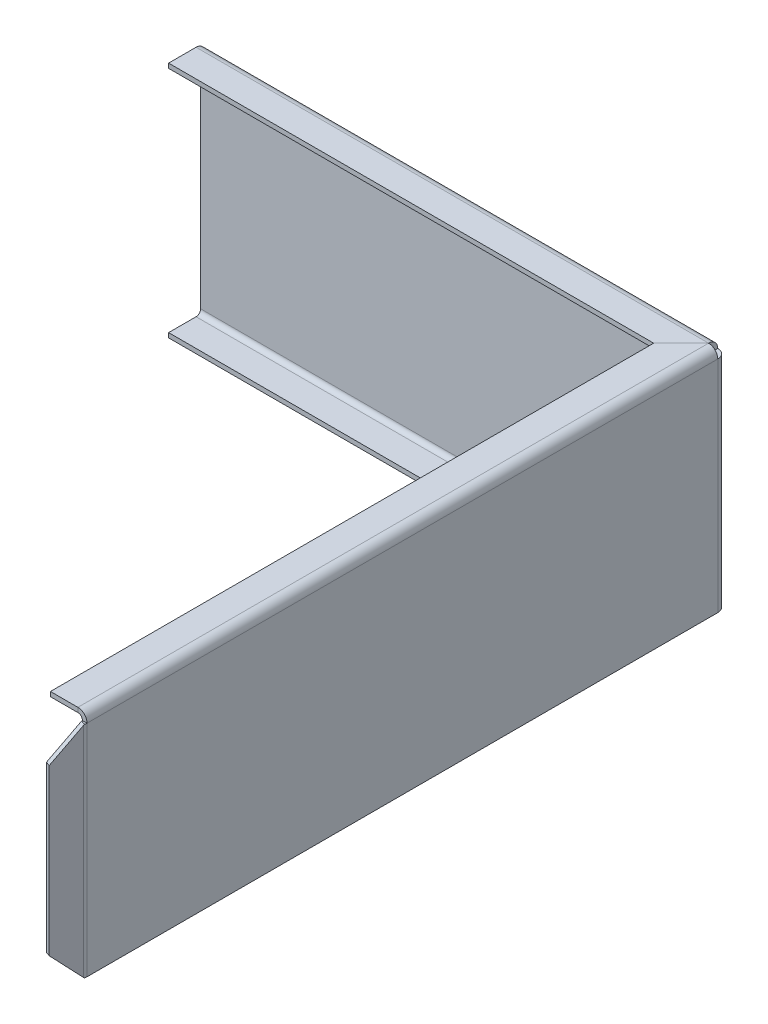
ISO-10303-21;
HEADER;
FILE_DESCRIPTION(('STEP AP214'),'2;1');
FILE_NAME('part.step','',(''),(''),'','','');
FILE_SCHEMA(('AUTOMOTIVE_DESIGN { 1 0 10303 214 1 1 1 1 }'));
ENDSEC;
DATA;
#1=APPLICATION_CONTEXT('core data for automotive mechanical design processes');
#2=APPLICATION_PROTOCOL_DEFINITION('international standard','automotive_design',2000,#1);
#3=PRODUCT_CONTEXT('',#1,'mechanical');
#4=PRODUCT('Part','Part','',(#3));
#5=PRODUCT_RELATED_PRODUCT_CATEGORY('part','',(#4));
#6=PRODUCT_DEFINITION_FORMATION('','',#4);
#7=PRODUCT_DEFINITION_CONTEXT('part definition',#1,'design');
#8=PRODUCT_DEFINITION('design','',#6,#7);
#9=PRODUCT_DEFINITION_SHAPE('','',#8);
#10=(LENGTH_UNIT() NAMED_UNIT(*) SI_UNIT(.MILLI.,.METRE.));
#11=(NAMED_UNIT(*) PLANE_ANGLE_UNIT() SI_UNIT($,.RADIAN.));
#12=(NAMED_UNIT(*) SI_UNIT($,.STERADIAN.) SOLID_ANGLE_UNIT());
#13=UNCERTAINTY_MEASURE_WITH_UNIT(LENGTH_MEASURE(1.E-05),#10,'distance_accuracy_value','');
#14=(GEOMETRIC_REPRESENTATION_CONTEXT(3) GLOBAL_UNCERTAINTY_ASSIGNED_CONTEXT((#13)) GLOBAL_UNIT_ASSIGNED_CONTEXT((#10,
#11,#12)) REPRESENTATION_CONTEXT('',''));
#15=CARTESIAN_POINT('',(0.,0.,0.));
#16=DIRECTION('',(0.,0.,1.));
#17=DIRECTION('',(1.,0.,0.));
#18=AXIS2_PLACEMENT_3D('',#15,#16,#17);
#19=CARTESIAN_POINT('',(145.,0.,2.5));
#20=DIRECTION('',(-1.,0.,0.));
#21=DIRECTION('',(0.,0.,1.));
#22=AXIS2_PLACEMENT_3D('',#19,#20,#21);
#23=PLANE('',#22);
#24=DIRECTION('',(0.,1.,0.));
#25=VECTOR('',#24,1.);
#26=CARTESIAN_POINT('',(145.000000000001,120.,349.559182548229));
#27=LINE('',#26,#25);
#28=CARTESIAN_POINT('',(145.000000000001,120.,349.559182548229));
#29=VERTEX_POINT('',#28);
#30=CARTESIAN_POINT('',(145.000000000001,0.,349.559182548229));
#31=VERTEX_POINT('',#30);
#32=EDGE_CURVE('E443',#29,#31,#27,.F.);
#33=ORIENTED_EDGE('',*,*,#32,.T.);
#34=DIRECTION('',(0.,0.,-1.));
#35=VECTOR('',#34,1.);
#36=CARTESIAN_POINT('',(145.000000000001,0.,350.));
#37=LINE('',#36,#35);
#38=CARTESIAN_POINT('',(145.,0.,5.));
#39=VERTEX_POINT('',#38);
#40=EDGE_CURVE('E466',#39,#31,#37,.F.);
#41=ORIENTED_EDGE('',*,*,#40,.F.);
#42=DIRECTION('',(0.,1.,0.));
#43=VECTOR('',#42,1.);
#44=CARTESIAN_POINT('',(145.,0.,5.));
#45=LINE('',#44,#43);
#46=CARTESIAN_POINT('',(145.,120.,4.99999999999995));
#47=VERTEX_POINT('',#46);
#48=EDGE_CURVE('E477',#47,#39,#45,.F.);
#49=ORIENTED_EDGE('',*,*,#48,.F.);
#50=DIRECTION('',(0.,0.,1.));
#51=VECTOR('',#50,1.);
#52=CARTESIAN_POINT('',(145.,120.,2.5));
#53=LINE('',#52,#51);
#54=EDGE_CURVE('E461',#29,#47,#53,.F.);
#55=ORIENTED_EDGE('',*,*,#54,.F.);
#56=EDGE_LOOP('',(#33,#41,#49,#55));
#57=FACE_BOUND('',#56,.T.);
#58=ADVANCED_FACE('F111',(#57),#23,.F.);
#59=CARTESIAN_POINT('',(142.5,0.,2.5));
#60=DIRECTION('',(-1.,0.,0.));
#61=DIRECTION('',(0.,0.,1.));
#62=AXIS2_PLACEMENT_3D('',#59,#60,#61);
#63=PLANE('',#62);
#64=DIRECTION('',(0.,0.,1.));
#65=VECTOR('',#64,1.);
#66=CARTESIAN_POINT('',(142.5,0.,2.5));
#67=LINE('',#66,#65);
#68=CARTESIAN_POINT('',(142.5,0.,5.));
#69=VERTEX_POINT('',#68);
#70=CARTESIAN_POINT('',(142.500000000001,0.,349.559182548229));
#71=VERTEX_POINT('',#70);
#72=EDGE_CURVE('E473',#69,#71,#67,.T.);
#73=ORIENTED_EDGE('',*,*,#72,.T.);
#74=DIRECTION('',(0.,1.,0.));
#75=VECTOR('',#74,1.);
#76=CARTESIAN_POINT('',(142.500000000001,120.,349.559182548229));
#77=LINE('',#76,#75);
#78=CARTESIAN_POINT('',(142.500000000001,120.,349.559182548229));
#79=VERTEX_POINT('',#78);
#80=EDGE_CURVE('E437',#79,#71,#77,.F.);
#81=ORIENTED_EDGE('',*,*,#80,.F.);
#82=DIRECTION('',(0.,0.,-1.));
#83=VECTOR('',#82,1.);
#84=CARTESIAN_POINT('',(142.5,120.,2.5));
#85=LINE('',#84,#83);
#86=CARTESIAN_POINT('',(142.5,120.,5.));
#87=VERTEX_POINT('',#86);
#88=EDGE_CURVE('E470',#79,#87,#85,.T.);
#89=ORIENTED_EDGE('',*,*,#88,.T.);
#90=DIRECTION('',(0.,1.,0.));
#91=VECTOR('',#90,1.);
#92=CARTESIAN_POINT('',(142.5,0.,5.));
#93=LINE('',#92,#91);
#94=EDGE_CURVE('E484',#69,#87,#93,.T.);
#95=ORIENTED_EDGE('',*,*,#94,.F.);
#96=EDGE_LOOP('',(#73,#81,#89,#95));
#97=FACE_BOUND('',#96,.T.);
#98=ADVANCED_FACE('F741',(#97),#63,.T.);
#99=CARTESIAN_POINT('',(140.,120.,0.));
#100=DIRECTION('',(1.,0.,0.));
#101=DIRECTION('',(0.,0.,-1.));
#102=AXIS2_PLACEMENT_3D('',#99,#100,#101);
#103=PLANE('',#102);
#104=DIRECTION('',(0.,0.,1.));
#105=VECTOR('',#104,1.);
#106=CARTESIAN_POINT('',(140.,120.,0.));
#107=LINE('',#106,#105);
#108=CARTESIAN_POINT('',(140.,120.,0.));
#109=VERTEX_POINT('',#108);
#110=CARTESIAN_POINT('',(140.,120.,2.5));
#111=VERTEX_POINT('',#110);
#112=EDGE_CURVE('E652',#109,#111,#107,.T.);
#113=ORIENTED_EDGE('',*,*,#112,.F.);
#114=CARTESIAN_POINT('',(140.,120.,5.));
#115=DIRECTION('',(-1.,0.,0.));
#116=DIRECTION('',(0.,0.,1.));
#117=AXIS2_PLACEMENT_3D('',#114,#115,#116);
#118=CIRCLE('',#117,5.);
#119=CARTESIAN_POINT('',(140.,125.,5.));
#120=VERTEX_POINT('',#119);
#121=EDGE_CURVE('E610',#109,#120,#118,.F.);
#122=ORIENTED_EDGE('',*,*,#121,.T.);
#123=DIRECTION('',(0.,1.,0.));
#124=VECTOR('',#123,1.);
#125=CARTESIAN_POINT('',(140.,122.5,5.));
#126=LINE('',#125,#124);
#127=CARTESIAN_POINT('',(140.,122.5,5.));
#128=VERTEX_POINT('',#127);
#129=EDGE_CURVE('E649',#128,#120,#126,.T.);
#130=ORIENTED_EDGE('',*,*,#129,.F.);
#131=CARTESIAN_POINT('',(140.,120.,5.));
#132=DIRECTION('',(1.,0.,0.));
#133=DIRECTION('',(0.,0.,-1.));
#134=AXIS2_PLACEMENT_3D('',#131,#132,#133);
#135=CIRCLE('',#134,2.5);
#136=EDGE_CURVE('E595',#111,#128,#135,.T.);
#137=ORIENTED_EDGE('',*,*,#136,.F.);
#138=EDGE_LOOP('',(#113,#122,#130,#137));
#139=FACE_BOUND('',#138,.T.);
#140=ADVANCED_FACE('F113',(#139),#103,.T.);
#141=CARTESIAN_POINT('',(-140.,125.,5.));
#142=DIRECTION('',(-1.,0.,0.));
#143=DIRECTION('',(0.,0.,1.));
#144=AXIS2_PLACEMENT_3D('',#141,#142,#143);
#145=PLANE('',#144);
#146=DIRECTION('',(0.,-1.,0.));
#147=VECTOR('',#146,1.);
#148=CARTESIAN_POINT('',(-140.,125.,5.));
#149=LINE('',#148,#147);
#150=CARTESIAN_POINT('',(-140.,125.,5.));
#151=VERTEX_POINT('',#150);
#152=CARTESIAN_POINT('',(-140.,122.5,5.));
#153=VERTEX_POINT('',#152);
#154=EDGE_CURVE('E646',#151,#153,#149,.T.);
#155=ORIENTED_EDGE('',*,*,#154,.F.);
#156=CARTESIAN_POINT('',(-140.,120.,5.));
#157=DIRECTION('',(-1.,0.,0.));
#158=DIRECTION('',(0.,0.,1.));
#159=AXIS2_PLACEMENT_3D('',#156,#157,#158);
#160=CIRCLE('',#159,5.);
#161=CARTESIAN_POINT('',(-140.,120.,0.));
#162=VERTEX_POINT('',#161);
#163=EDGE_CURVE('E591',#162,#151,#160,.F.);
#164=ORIENTED_EDGE('',*,*,#163,.F.);
#165=DIRECTION('',(0.,0.,-1.));
#166=VECTOR('',#165,1.);
#167=CARTESIAN_POINT('',(-140.,120.,2.5));
#168=LINE('',#167,#166);
#169=CARTESIAN_POINT('',(-140.,120.,2.5));
#170=VERTEX_POINT('',#169);
#171=EDGE_CURVE('E643',#170,#162,#168,.T.);
#172=ORIENTED_EDGE('',*,*,#171,.F.);
#173=CARTESIAN_POINT('',(-140.,120.,5.));
#174=DIRECTION('',(1.,0.,0.));
#175=DIRECTION('',(0.,0.,-1.));
#176=AXIS2_PLACEMENT_3D('',#173,#174,#175);
#177=CIRCLE('',#176,2.5);
#178=EDGE_CURVE('E575',#170,#153,#177,.T.);
#179=ORIENTED_EDGE('',*,*,#178,.T.);
#180=EDGE_LOOP('',(#155,#164,#172,#179));
#181=FACE_BOUND('',#180,.T.);
#182=ADVANCED_FACE('F718',(#181),#145,.T.);
#183=CARTESIAN_POINT('',(-140.,120.,2.5));
#184=DIRECTION('',(-1.,0.,0.));
#185=DIRECTION('',(0.,0.,1.));
#186=AXIS2_PLACEMENT_3D('',#183,#184,#185);
#187=PLANE('',#186);
#188=DIRECTION('',(0.,0.,1.));
#189=VECTOR('',#188,1.);
#190=CARTESIAN_POINT('',(-140.,125.,0.));
#191=LINE('',#190,#189);
#192=CARTESIAN_POINT('',(-140.,125.,20.));
#193=VERTEX_POINT('',#192);
#194=EDGE_CURVE('E560',#151,#193,#191,.T.);
#195=ORIENTED_EDGE('',*,*,#194,.F.);
#196=ORIENTED_EDGE('',*,*,#154,.T.);
#197=DIRECTION('',(0.,0.,-1.));
#198=VECTOR('',#197,1.);
#199=CARTESIAN_POINT('',(-140.,122.5,0.));
#200=LINE('',#199,#198);
#201=CARTESIAN_POINT('',(-140.,122.5,20.));
#202=VERTEX_POINT('',#201);
#203=EDGE_CURVE('E571',#153,#202,#200,.F.);
#204=ORIENTED_EDGE('',*,*,#203,.T.);
#205=DIRECTION('',(0.,1.,0.));
#206=VECTOR('',#205,1.);
#207=CARTESIAN_POINT('',(-140.,122.5,20.));
#208=LINE('',#207,#206);
#209=EDGE_CURVE('E567',#202,#193,#208,.T.);
#210=ORIENTED_EDGE('',*,*,#209,.T.);
#211=EDGE_LOOP('',(#195,#196,#204,#210));
#212=FACE_BOUND('',#211,.T.);
#213=ADVANCED_FACE('F1296',(#212),#187,.T.);
#214=CARTESIAN_POINT('',(140.,125.,0.));
#215=DIRECTION('',(0.,-1.,0.));
#216=DIRECTION('',(0.,0.,-1.));
#217=AXIS2_PLACEMENT_3D('',#214,#215,#216);
#218=PLANE('',#217);
#219=DIRECTION('',(-1.,0.,0.));
#220=VECTOR('',#219,1.);
#221=CARTESIAN_POINT('',(140.,125.,20.));
#222=LINE('',#221,#220);
#223=CARTESIAN_POINT('',(125.,125.,20.));
#224=VERTEX_POINT('',#223);
#225=EDGE_CURVE('E640',#224,#193,#222,.T.);
#226=ORIENTED_EDGE('',*,*,#225,.F.);
#227=DIRECTION('',(-0.707106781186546,0.,0.707106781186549));
#228=VECTOR('',#227,1.);
#229=CARTESIAN_POINT('',(125.,125.,20.));
#230=LINE('',#229,#228);
#231=EDGE_CURVE('E120',#224,#120,#230,.F.);
#232=ORIENTED_EDGE('',*,*,#231,.T.);
#233=DIRECTION('',(-1.,0.,0.));
#234=VECTOR('',#233,1.);
#235=CARTESIAN_POINT('',(140.,125.,5.));
#236=LINE('',#235,#234);
#237=EDGE_CURVE('E614',#120,#151,#236,.T.);
#238=ORIENTED_EDGE('',*,*,#237,.T.);
#239=ORIENTED_EDGE('',*,*,#194,.T.);
#240=EDGE_LOOP('',(#226,#232,#238,#239));
#241=FACE_BOUND('',#240,.T.);
#242=ADVANCED_FACE('F699',(#241),#218,.F.);
#243=CARTESIAN_POINT('',(140.,122.5,20.));
#244=DIRECTION('',(0.,0.,1.));
#245=DIRECTION('',(1.,0.,0.));
#246=AXIS2_PLACEMENT_3D('',#243,#244,#245);
#247=PLANE('',#246);
#248=DIRECTION('',(-1.,0.,0.));
#249=VECTOR('',#248,1.);
#250=CARTESIAN_POINT('',(140.,122.5,20.));
#251=LINE('',#250,#249);
#252=CARTESIAN_POINT('',(125.,122.5,20.));
#253=VERTEX_POINT('',#252);
#254=EDGE_CURVE('E637',#253,#202,#251,.T.);
#255=ORIENTED_EDGE('',*,*,#254,.F.);
#256=DIRECTION('',(0.,1.,0.));
#257=VECTOR('',#256,1.);
#258=CARTESIAN_POINT('',(125.,122.5,20.));
#259=LINE('',#258,#257);
#260=EDGE_CURVE('E694',#253,#224,#259,.T.);
#261=ORIENTED_EDGE('',*,*,#260,.T.);
#262=ORIENTED_EDGE('',*,*,#225,.T.);
#263=ORIENTED_EDGE('',*,*,#209,.F.);
#264=EDGE_LOOP('',(#255,#261,#262,#263));
#265=FACE_BOUND('',#264,.T.);
#266=ADVANCED_FACE('F711',(#265),#247,.T.);
#267=CARTESIAN_POINT('',(140.,122.5,0.));
#268=DIRECTION('',(0.,-1.,0.));
#269=DIRECTION('',(0.,0.,-1.));
#270=AXIS2_PLACEMENT_3D('',#267,#268,#269);
#271=PLANE('',#270);
#272=DIRECTION('',(-1.,0.,0.));
#273=VECTOR('',#272,1.);
#274=CARTESIAN_POINT('',(140.,122.5,5.));
#275=LINE('',#274,#273);
#276=EDGE_CURVE('E633',#128,#153,#275,.T.);
#277=ORIENTED_EDGE('',*,*,#276,.F.);
#278=DIRECTION('',(0.707106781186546,0.,-0.707106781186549));
#279=VECTOR('',#278,1.);
#280=CARTESIAN_POINT('',(142.5,122.5,2.49999999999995));
#281=LINE('',#280,#279);
#282=EDGE_CURVE('E15',#128,#253,#281,.F.);
#283=ORIENTED_EDGE('',*,*,#282,.T.);
#284=ORIENTED_EDGE('',*,*,#254,.T.);
#285=ORIENTED_EDGE('',*,*,#203,.F.);
#286=EDGE_LOOP('',(#277,#283,#284,#285));
#287=FACE_BOUND('',#286,.T.);
#288=ADVANCED_FACE('F714',(#287),#271,.T.);
#289=CARTESIAN_POINT('',(140.,120.,5.));
#290=DIRECTION('',(-1.,0.,0.));
#291=DIRECTION('',(0.,0.,1.));
#292=AXIS2_PLACEMENT_3D('',#289,#290,#291);
#293=CYLINDRICAL_SURFACE('',#292,2.5);
#294=ORIENTED_EDGE('',*,*,#178,.F.);
#295=DIRECTION('',(-1.,0.,0.));
#296=VECTOR('',#295,1.);
#297=CARTESIAN_POINT('',(140.,120.,2.5));
#298=LINE('',#297,#296);
#299=EDGE_CURVE('E629',#111,#170,#298,.T.);
#300=ORIENTED_EDGE('',*,*,#299,.F.);
#301=ORIENTED_EDGE('',*,*,#136,.T.);
#302=ORIENTED_EDGE('',*,*,#276,.T.);
#303=EDGE_LOOP('',(#294,#300,#301,#302));
#304=FACE_BOUND('',#303,.T.);
#305=ADVANCED_FACE('F720',(#304),#293,.F.);
#306=CARTESIAN_POINT('',(140.,0.,2.5));
#307=DIRECTION('',(0.,0.,1.));
#308=DIRECTION('',(1.,0.,0.));
#309=AXIS2_PLACEMENT_3D('',#306,#307,#308);
#310=PLANE('',#309);
#311=CARTESIAN_POINT('',(127.5,15.,2.5));
#312=DIRECTION('',(0.,0.,1.));
#313=DIRECTION('',(1.,0.,0.));
#314=AXIS2_PLACEMENT_3D('',#311,#312,#313);
#315=CIRCLE('',#314,10.);
#316=CARTESIAN_POINT('',(127.5,5.,2.5));
#317=VERTEX_POINT('',#316);
#318=CARTESIAN_POINT('',(127.5,25.,2.5));
#319=VERTEX_POINT('',#318);
#320=EDGE_CURVE('E413',#317,#319,#315,.T.);
#321=ORIENTED_EDGE('',*,*,#320,.F.);
#322=DIRECTION('',(1.,0.,0.));
#323=VECTOR('',#322,1.);
#324=CARTESIAN_POINT('',(140.,5.,2.5));
#325=LINE('',#324,#323);
#326=CARTESIAN_POINT('',(102.5,5.,2.5));
#327=VERTEX_POINT('',#326);
#328=EDGE_CURVE('E394',#327,#317,#325,.T.);
#329=ORIENTED_EDGE('',*,*,#328,.F.);
#330=CARTESIAN_POINT('',(102.5,15.,2.5));
#331=DIRECTION('',(0.,0.,1.));
#332=DIRECTION('',(1.,0.,0.));
#333=AXIS2_PLACEMENT_3D('',#330,#331,#332);
#334=CIRCLE('',#333,10.);
#335=CARTESIAN_POINT('',(102.5,25.,2.5));
#336=VERTEX_POINT('',#335);
#337=EDGE_CURVE('E406',#336,#327,#334,.T.);
#338=ORIENTED_EDGE('',*,*,#337,.F.);
#339=DIRECTION('',(-1.,0.,0.));
#340=VECTOR('',#339,1.);
#341=CARTESIAN_POINT('',(140.,25.,2.5));
#342=LINE('',#341,#340);
#343=EDGE_CURVE('E410',#319,#336,#342,.T.);
#344=ORIENTED_EDGE('',*,*,#343,.F.);
#345=EDGE_LOOP('',(#321,#329,#338,#344));
#346=FACE_BOUND('',#345,.T.);
#347=DIRECTION('',(0.,1.,0.));
#348=VECTOR('',#347,1.);
#349=CARTESIAN_POINT('',(-140.,0.,2.5));
#350=LINE('',#349,#348);
#351=CARTESIAN_POINT('',(-140.,0.,2.5));
#352=VERTEX_POINT('',#351);
#353=EDGE_CURVE('E579',#352,#170,#350,.T.);
#354=ORIENTED_EDGE('',*,*,#353,.F.);
#355=DIRECTION('',(-1.,0.,0.));
#356=VECTOR('',#355,1.);
#357=CARTESIAN_POINT('',(140.,0.,2.5));
#358=LINE('',#357,#356);
#359=CARTESIAN_POINT('',(140.,0.,2.5));
#360=VERTEX_POINT('',#359);
#361=EDGE_CURVE('E626',#360,#352,#358,.T.);
#362=ORIENTED_EDGE('',*,*,#361,.F.);
#363=DIRECTION('',(0.,1.,0.));
#364=VECTOR('',#363,1.);
#365=CARTESIAN_POINT('',(140.,0.,2.5));
#366=LINE('',#365,#364);
#367=EDGE_CURVE('E599',#360,#111,#366,.T.);
#368=ORIENTED_EDGE('',*,*,#367,.T.);
#369=ORIENTED_EDGE('',*,*,#299,.T.);
#370=EDGE_LOOP('',(#354,#362,#368,#369));
#371=FACE_BOUND('',#370,.T.);
#372=ADVANCED_FACE('F728',(#346,#371),#310,.T.);
#373=CARTESIAN_POINT('',(140.,0.,0.));
#374=DIRECTION('',(0.,0.,1.));
#375=DIRECTION('',(1.,0.,0.));
#376=AXIS2_PLACEMENT_3D('',#373,#374,#375);
#377=PLANE('',#376);
#378=DIRECTION('',(-1.,0.,0.));
#379=VECTOR('',#378,1.);
#380=CARTESIAN_POINT('',(127.5,5.,0.));
#381=LINE('',#380,#379);
#382=CARTESIAN_POINT('',(127.5,5.,0.));
#383=VERTEX_POINT('',#382);
#384=CARTESIAN_POINT('',(102.5,5.,0.));
#385=VERTEX_POINT('',#384);
#386=EDGE_CURVE('E378',#383,#385,#381,.T.);
#387=ORIENTED_EDGE('',*,*,#386,.F.);
#388=CARTESIAN_POINT('',(127.5,15.,0.));
#389=DIRECTION('',(0.,0.,-1.));
#390=DIRECTION('',(1.,0.,0.));
#391=AXIS2_PLACEMENT_3D('',#388,#389,#390);
#392=CIRCLE('',#391,10.);
#393=CARTESIAN_POINT('',(127.5,25.,0.));
#394=VERTEX_POINT('',#393);
#395=EDGE_CURVE('E372',#394,#383,#392,.T.);
#396=ORIENTED_EDGE('',*,*,#395,.F.);
#397=DIRECTION('',(1.,0.,0.));
#398=VECTOR('',#397,1.);
#399=CARTESIAN_POINT('',(127.5,25.,0.));
#400=LINE('',#399,#398);
#401=CARTESIAN_POINT('',(102.5,25.,0.));
#402=VERTEX_POINT('',#401);
#403=EDGE_CURVE('E386',#402,#394,#400,.T.);
#404=ORIENTED_EDGE('',*,*,#403,.F.);
#405=CARTESIAN_POINT('',(102.5,15.,0.));
#406=DIRECTION('',(0.,0.,-1.));
#407=DIRECTION('',(-1.,0.,0.));
#408=AXIS2_PLACEMENT_3D('',#405,#406,#407);
#409=CIRCLE('',#408,10.);
#410=EDGE_CURVE('E382',#385,#402,#409,.T.);
#411=ORIENTED_EDGE('',*,*,#410,.F.);
#412=EDGE_LOOP('',(#387,#396,#404,#411));
#413=FACE_BOUND('',#412,.T.);
#414=DIRECTION('',(0.,1.,0.));
#415=VECTOR('',#414,1.);
#416=CARTESIAN_POINT('',(-140.,0.,0.));
#417=LINE('',#416,#415);
#418=CARTESIAN_POINT('',(-140.,0.,0.));
#419=VERTEX_POINT('',#418);
#420=EDGE_CURVE('E587',#419,#162,#417,.T.);
#421=ORIENTED_EDGE('',*,*,#420,.T.);
#422=DIRECTION('',(-1.,0.,0.));
#423=VECTOR('',#422,1.);
#424=CARTESIAN_POINT('',(140.,120.,0.));
#425=LINE('',#424,#423);
#426=EDGE_CURVE('E618',#109,#162,#425,.T.);
#427=ORIENTED_EDGE('',*,*,#426,.F.);
#428=DIRECTION('',(0.,1.,0.));
#429=VECTOR('',#428,1.);
#430=CARTESIAN_POINT('',(140.,0.,0.));
#431=LINE('',#430,#429);
#432=CARTESIAN_POINT('',(140.,0.,0.));
#433=VERTEX_POINT('',#432);
#434=EDGE_CURVE('E606',#433,#109,#431,.T.);
#435=ORIENTED_EDGE('',*,*,#434,.F.);
#436=DIRECTION('',(-1.,0.,0.));
#437=VECTOR('',#436,1.);
#438=CARTESIAN_POINT('',(140.,0.,0.));
#439=LINE('',#438,#437);
#440=EDGE_CURVE('E622',#433,#419,#439,.T.);
#441=ORIENTED_EDGE('',*,*,#440,.T.);
#442=EDGE_LOOP('',(#421,#427,#435,#441));
#443=FACE_BOUND('',#442,.T.);
#444=ADVANCED_FACE('F801',(#413,#443),#377,.F.);
#445=CARTESIAN_POINT('',(140.,120.,5.));
#446=DIRECTION('',(-1.,0.,0.));
#447=DIRECTION('',(0.,0.,1.));
#448=AXIS2_PLACEMENT_3D('',#445,#446,#447);
#449=CYLINDRICAL_SURFACE('',#448,5.);
#450=ORIENTED_EDGE('',*,*,#163,.T.);
#451=ORIENTED_EDGE('',*,*,#237,.F.);
#452=ORIENTED_EDGE('',*,*,#121,.F.);
#453=ORIENTED_EDGE('',*,*,#426,.T.);
#454=EDGE_LOOP('',(#450,#451,#452,#453));
#455=FACE_BOUND('',#454,.T.);
#456=ADVANCED_FACE('F707',(#455),#449,.T.);
#457=CARTESIAN_POINT('',(-140.,120.,5.));
#458=DIRECTION('',(1.,0.,0.));
#459=DIRECTION('',(0.,0.,-1.));
#460=AXIS2_PLACEMENT_3D('',#457,#458,#459);
#461=PLANE('',#460);
#462=ORIENTED_EDGE('',*,*,#353,.T.);
#463=ORIENTED_EDGE('',*,*,#171,.T.);
#464=ORIENTED_EDGE('',*,*,#420,.F.);
#465=DIRECTION('',(0.,0.,1.));
#466=VECTOR('',#465,1.);
#467=CARTESIAN_POINT('',(-140.,0.,0.));
#468=LINE('',#467,#466);
#469=EDGE_CURVE('E583',#419,#352,#468,.T.);
#470=ORIENTED_EDGE('',*,*,#469,.T.);
#471=EDGE_LOOP('',(#462,#463,#464,#470));
#472=FACE_BOUND('',#471,.T.);
#473=ADVANCED_FACE('F723',(#472),#461,.F.);
#474=CARTESIAN_POINT('',(-140.,0.,5.));
#475=DIRECTION('',(-1.,0.,0.));
#476=DIRECTION('',(0.,0.,1.));
#477=AXIS2_PLACEMENT_3D('',#474,#475,#476);
#478=PLANE('',#477);
#479=DIRECTION('',(0.,1.,0.));
#480=VECTOR('',#479,1.);
#481=CARTESIAN_POINT('',(-140.,-5.,5.));
#482=LINE('',#481,#480);
#483=CARTESIAN_POINT('',(-140.,-2.49999999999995,5.));
#484=VERTEX_POINT('',#483);
#485=CARTESIAN_POINT('',(-140.,-5.,5.));
#486=VERTEX_POINT('',#485);
#487=EDGE_CURVE('E503',#484,#486,#482,.F.);
#488=ORIENTED_EDGE('',*,*,#487,.F.);
#489=CARTESIAN_POINT('',(-140.,0.,5.));
#490=DIRECTION('',(1.,0.,0.));
#491=DIRECTION('',(0.,0.,-1.));
#492=AXIS2_PLACEMENT_3D('',#489,#490,#491);
#493=CIRCLE('',#492,2.5);
#494=EDGE_CURVE('E548',#352,#484,#493,.F.);
#495=ORIENTED_EDGE('',*,*,#494,.F.);
#496=ORIENTED_EDGE('',*,*,#469,.F.);
#497=CARTESIAN_POINT('',(-140.,0.,5.));
#498=DIRECTION('',(1.,0.,0.));
#499=DIRECTION('',(0.,0.,-1.));
#500=AXIS2_PLACEMENT_3D('',#497,#498,#499);
#501=CIRCLE('',#500,5.);
#502=EDGE_CURVE('E556',#419,#486,#501,.F.);
#503=ORIENTED_EDGE('',*,*,#502,.T.);
#504=EDGE_LOOP('',(#488,#495,#496,#503));
#505=FACE_BOUND('',#504,.T.);
#506=ADVANCED_FACE('F834',(#505),#478,.T.);
#507=CARTESIAN_POINT('',(140.,0.,5.));
#508=DIRECTION('',(-1.,0.,0.));
#509=DIRECTION('',(0.,0.,1.));
#510=AXIS2_PLACEMENT_3D('',#507,#508,#509);
#511=PLANE('',#510);
#512=CARTESIAN_POINT('',(140.,0.,5.));
#513=DIRECTION('',(1.,0.,0.));
#514=DIRECTION('',(0.,0.,-1.));
#515=AXIS2_PLACEMENT_3D('',#512,#513,#514);
#516=CIRCLE('',#515,2.5);
#517=CARTESIAN_POINT('',(140.,-2.49999999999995,5.));
#518=VERTEX_POINT('',#517);
#519=EDGE_CURVE('E511',#518,#360,#516,.T.);
#520=ORIENTED_EDGE('',*,*,#519,.F.);
#521=DIRECTION('',(0.,1.,0.));
#522=VECTOR('',#521,1.);
#523=CARTESIAN_POINT('',(140.,-2.49999999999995,5.));
#524=LINE('',#523,#522);
#525=CARTESIAN_POINT('',(140.,-5.,5.));
#526=VERTEX_POINT('',#525);
#527=EDGE_CURVE('E538',#518,#526,#524,.F.);
#528=ORIENTED_EDGE('',*,*,#527,.T.);
#529=CARTESIAN_POINT('',(140.,0.,5.));
#530=DIRECTION('',(1.,0.,0.));
#531=DIRECTION('',(0.,0.,-1.));
#532=AXIS2_PLACEMENT_3D('',#529,#530,#531);
#533=CIRCLE('',#532,5.);
#534=EDGE_CURVE('E552',#526,#433,#533,.T.);
#535=ORIENTED_EDGE('',*,*,#534,.T.);
#536=DIRECTION('',(0.,0.,1.));
#537=VECTOR('',#536,1.);
#538=CARTESIAN_POINT('',(140.,0.,0.));
#539=LINE('',#538,#537);
#540=EDGE_CURVE('E603',#433,#360,#539,.T.);
#541=ORIENTED_EDGE('',*,*,#540,.T.);
#542=EDGE_LOOP('',(#520,#528,#535,#541));
#543=FACE_BOUND('',#542,.T.);
#544=ADVANCED_FACE('F806',(#543),#511,.F.);
#545=CARTESIAN_POINT('',(140.,0.,5.));
#546=DIRECTION('',(1.,0.,0.));
#547=DIRECTION('',(0.,-1.,0.));
#548=AXIS2_PLACEMENT_3D('',#545,#546,#547);
#549=CYLINDRICAL_SURFACE('',#548,5.);
#550=ORIENTED_EDGE('',*,*,#440,.F.);
#551=ORIENTED_EDGE('',*,*,#534,.F.);
#552=DIRECTION('',(1.,0.,0.));
#553=VECTOR('',#552,1.);
#554=CARTESIAN_POINT('',(-140.,-5.,5.));
#555=LINE('',#554,#553);
#556=EDGE_CURVE('E535',#526,#486,#555,.F.);
#557=ORIENTED_EDGE('',*,*,#556,.T.);
#558=ORIENTED_EDGE('',*,*,#502,.F.);
#559=EDGE_LOOP('',(#550,#551,#557,#558));
#560=FACE_BOUND('',#559,.T.);
#561=ADVANCED_FACE('F832',(#560),#549,.T.);
#562=CARTESIAN_POINT('',(140.,0.,5.));
#563=DIRECTION('',(1.,0.,0.));
#564=DIRECTION('',(0.,-1.,0.));
#565=AXIS2_PLACEMENT_3D('',#562,#563,#564);
#566=CYLINDRICAL_SURFACE('',#565,2.5);
#567=ORIENTED_EDGE('',*,*,#361,.T.);
#568=ORIENTED_EDGE('',*,*,#494,.T.);
#569=DIRECTION('',(1.,0.,0.));
#570=VECTOR('',#569,1.);
#571=CARTESIAN_POINT('',(-140.,-2.49999999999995,5.));
#572=LINE('',#571,#570);
#573=EDGE_CURVE('E542',#484,#518,#572,.T.);
#574=ORIENTED_EDGE('',*,*,#573,.T.);
#575=ORIENTED_EDGE('',*,*,#519,.T.);
#576=EDGE_LOOP('',(#567,#568,#574,#575));
#577=FACE_BOUND('',#576,.T.);
#578=ADVANCED_FACE('F809',(#577),#566,.F.);
#579=CARTESIAN_POINT('',(140.,-5.,20.));
#580=DIRECTION('',(-1.,0.,0.));
#581=DIRECTION('',(0.,0.,1.));
#582=AXIS2_PLACEMENT_3D('',#579,#580,#581);
#583=PLANE('',#582);
#584=ORIENTED_EDGE('',*,*,#527,.F.);
#585=DIRECTION('',(0.,0.,-1.));
#586=VECTOR('',#585,1.);
#587=CARTESIAN_POINT('',(140.,-2.50000000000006,20.));
#588=LINE('',#587,#586);
#589=CARTESIAN_POINT('',(140.,-2.50000000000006,20.));
#590=VERTEX_POINT('',#589);
#591=EDGE_CURVE('E532',#518,#590,#588,.F.);
#592=ORIENTED_EDGE('',*,*,#591,.T.);
#593=DIRECTION('',(0.,1.,0.));
#594=VECTOR('',#593,1.);
#595=CARTESIAN_POINT('',(140.,-5.,20.));
#596=LINE('',#595,#594);
#597=CARTESIAN_POINT('',(140.,-5.,20.));
#598=VERTEX_POINT('',#597);
#599=EDGE_CURVE('E507',#598,#590,#596,.T.);
#600=ORIENTED_EDGE('',*,*,#599,.F.);
#601=DIRECTION('',(0.,0.,1.));
#602=VECTOR('',#601,1.);
#603=CARTESIAN_POINT('',(140.,-5.,2.5));
#604=LINE('',#603,#602);
#605=EDGE_CURVE('E523',#526,#598,#604,.T.);
#606=ORIENTED_EDGE('',*,*,#605,.F.);
#607=EDGE_LOOP('',(#584,#592,#600,#606));
#608=FACE_BOUND('',#607,.T.);
#609=ADVANCED_FACE('F827',(#608),#583,.F.);
#610=CARTESIAN_POINT('',(-140.,-5.,2.5));
#611=DIRECTION('',(1.,0.,0.));
#612=DIRECTION('',(0.,0.,-1.));
#613=AXIS2_PLACEMENT_3D('',#610,#611,#612);
#614=PLANE('',#613);
#615=ORIENTED_EDGE('',*,*,#487,.T.);
#616=DIRECTION('',(0.,0.,-1.));
#617=VECTOR('',#616,1.);
#618=CARTESIAN_POINT('',(-140.,-5.,2.5));
#619=LINE('',#618,#617);
#620=CARTESIAN_POINT('',(-140.,-5.,20.));
#621=VERTEX_POINT('',#620);
#622=EDGE_CURVE('E516',#621,#486,#619,.T.);
#623=ORIENTED_EDGE('',*,*,#622,.F.);
#624=DIRECTION('',(0.,1.,0.));
#625=VECTOR('',#624,1.);
#626=CARTESIAN_POINT('',(-140.,-5.,20.));
#627=LINE('',#626,#625);
#628=CARTESIAN_POINT('',(-140.,-2.50000000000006,20.));
#629=VERTEX_POINT('',#628);
#630=EDGE_CURVE('E512',#621,#629,#627,.T.);
#631=ORIENTED_EDGE('',*,*,#630,.T.);
#632=DIRECTION('',(0.,0.,1.));
#633=VECTOR('',#632,1.);
#634=CARTESIAN_POINT('',(-140.,-2.49999999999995,2.5));
#635=LINE('',#634,#633);
#636=EDGE_CURVE('E526',#629,#484,#635,.F.);
#637=ORIENTED_EDGE('',*,*,#636,.T.);
#638=EDGE_LOOP('',(#615,#623,#631,#637));
#639=FACE_BOUND('',#638,.T.);
#640=ADVANCED_FACE('F818',(#639),#614,.F.);
#641=CARTESIAN_POINT('',(-140.,-5.,2.5));
#642=DIRECTION('',(0.,1.,0.));
#643=DIRECTION('',(0.,0.,1.));
#644=AXIS2_PLACEMENT_3D('',#641,#642,#643);
#645=PLANE('',#644);
#646=ORIENTED_EDGE('',*,*,#556,.F.);
#647=ORIENTED_EDGE('',*,*,#605,.T.);
#648=DIRECTION('',(-1.,0.,0.));
#649=VECTOR('',#648,1.);
#650=CARTESIAN_POINT('',(-140.,-5.,20.));
#651=LINE('',#650,#649);
#652=EDGE_CURVE('E520',#598,#621,#651,.T.);
#653=ORIENTED_EDGE('',*,*,#652,.T.);
#654=ORIENTED_EDGE('',*,*,#622,.T.);
#655=EDGE_LOOP('',(#646,#647,#653,#654));
#656=FACE_BOUND('',#655,.T.);
#657=ADVANCED_FACE('F830',(#656),#645,.F.);
#658=CARTESIAN_POINT('',(-140.,-2.49999999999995,2.5));
#659=DIRECTION('',(0.,1.,0.));
#660=DIRECTION('',(0.,0.,1.));
#661=AXIS2_PLACEMENT_3D('',#658,#659,#660);
#662=PLANE('',#661);
#663=ORIENTED_EDGE('',*,*,#591,.F.);
#664=ORIENTED_EDGE('',*,*,#573,.F.);
#665=ORIENTED_EDGE('',*,*,#636,.F.);
#666=DIRECTION('',(1.,0.,0.));
#667=VECTOR('',#666,1.);
#668=CARTESIAN_POINT('',(-140.,-2.50000000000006,20.));
#669=LINE('',#668,#667);
#670=EDGE_CURVE('E530',#590,#629,#669,.F.);
#671=ORIENTED_EDGE('',*,*,#670,.F.);
#672=EDGE_LOOP('',(#663,#664,#665,#671));
#673=FACE_BOUND('',#672,.T.);
#674=ADVANCED_FACE('F815',(#673),#662,.T.);
#675=CARTESIAN_POINT('',(-140.,-5.,20.));
#676=DIRECTION('',(0.,0.,-1.));
#677=DIRECTION('',(0.,1.,0.));
#678=AXIS2_PLACEMENT_3D('',#675,#676,#677);
#679=PLANE('',#678);
#680=ORIENTED_EDGE('',*,*,#670,.T.);
#681=ORIENTED_EDGE('',*,*,#630,.F.);
#682=ORIENTED_EDGE('',*,*,#652,.F.);
#683=ORIENTED_EDGE('',*,*,#599,.T.);
#684=EDGE_LOOP('',(#680,#681,#682,#683));
#685=FACE_BOUND('',#684,.T.);
#686=ADVANCED_FACE('F823',(#685),#679,.F.);
#687=CARTESIAN_POINT('',(140.,0.,5.));
#688=DIRECTION('',(0.,-1.,0.));
#689=DIRECTION('',(0.,0.,-1.));
#690=AXIS2_PLACEMENT_3D('',#687,#688,#689);
#691=PLANE('',#690);
#692=DIRECTION('',(1.,0.,0.));
#693=VECTOR('',#692,1.);
#694=CARTESIAN_POINT('',(145.,0.,5.));
#695=LINE('',#694,#693);
#696=EDGE_CURVE('E457',#69,#39,#695,.T.);
#697=ORIENTED_EDGE('',*,*,#696,.F.);
#698=CARTESIAN_POINT('',(140.,0.,5.));
#699=DIRECTION('',(0.,1.,0.));
#700=DIRECTION('',(0.,0.,1.));
#701=AXIS2_PLACEMENT_3D('',#698,#699,#700);
#702=CIRCLE('',#701,2.5);
#703=EDGE_CURVE('E491',#360,#69,#702,.F.);
#704=ORIENTED_EDGE('',*,*,#703,.F.);
#705=ORIENTED_EDGE('',*,*,#540,.F.);
#706=CARTESIAN_POINT('',(140.,0.,5.));
#707=DIRECTION('',(0.,1.,0.));
#708=DIRECTION('',(0.,0.,1.));
#709=AXIS2_PLACEMENT_3D('',#706,#707,#708);
#710=CIRCLE('',#709,5.);
#711=EDGE_CURVE('E499',#433,#39,#710,.F.);
#712=ORIENTED_EDGE('',*,*,#711,.T.);
#713=EDGE_LOOP('',(#697,#704,#705,#712));
#714=FACE_BOUND('',#713,.T.);
#715=ADVANCED_FACE('F803',(#714),#691,.T.);
#716=CARTESIAN_POINT('',(140.,120.,5.));
#717=DIRECTION('',(0.,-1.,0.));
#718=DIRECTION('',(0.,0.,-1.));
#719=AXIS2_PLACEMENT_3D('',#716,#717,#718);
#720=PLANE('',#719);
#721=CARTESIAN_POINT('',(140.,120.,5.));
#722=DIRECTION('',(0.,1.,0.));
#723=DIRECTION('',(0.,0.,1.));
#724=AXIS2_PLACEMENT_3D('',#721,#722,#723);
#725=CIRCLE('',#724,2.5);
#726=EDGE_CURVE('E465',#87,#111,#725,.T.);
#727=ORIENTED_EDGE('',*,*,#726,.F.);
#728=DIRECTION('',(1.,0.,0.));
#729=VECTOR('',#728,1.);
#730=CARTESIAN_POINT('',(142.5,120.,5.));
#731=LINE('',#730,#729);
#732=EDGE_CURVE('E480',#87,#47,#731,.T.);
#733=ORIENTED_EDGE('',*,*,#732,.T.);
#734=CARTESIAN_POINT('',(140.,120.,5.));
#735=DIRECTION('',(0.,1.,0.));
#736=DIRECTION('',(0.,0.,1.));
#737=AXIS2_PLACEMENT_3D('',#734,#735,#736);
#738=CIRCLE('',#737,5.);
#739=EDGE_CURVE('E495',#47,#109,#738,.T.);
#740=ORIENTED_EDGE('',*,*,#739,.T.);
#741=ORIENTED_EDGE('',*,*,#112,.T.);
#742=EDGE_LOOP('',(#727,#733,#740,#741));
#743=FACE_BOUND('',#742,.T.);
#744=ADVANCED_FACE('F734',(#743),#720,.F.);
#745=CARTESIAN_POINT('',(140.,120.,5.));
#746=DIRECTION('',(0.,1.,0.));
#747=DIRECTION('',(1.,0.,0.));
#748=AXIS2_PLACEMENT_3D('',#745,#746,#747);
#749=CYLINDRICAL_SURFACE('',#748,5.);
#750=ORIENTED_EDGE('',*,*,#434,.T.);
#751=ORIENTED_EDGE('',*,*,#739,.F.);
#752=ORIENTED_EDGE('',*,*,#48,.T.);
#753=ORIENTED_EDGE('',*,*,#711,.F.);
#754=EDGE_LOOP('',(#750,#751,#752,#753));
#755=FACE_BOUND('',#754,.T.);
#756=ADVANCED_FACE('F796',(#755),#749,.T.);
#757=CARTESIAN_POINT('',(140.,120.,5.));
#758=DIRECTION('',(0.,1.,0.));
#759=DIRECTION('',(1.,0.,0.));
#760=AXIS2_PLACEMENT_3D('',#757,#758,#759);
#761=CYLINDRICAL_SURFACE('',#760,2.5);
#762=ORIENTED_EDGE('',*,*,#367,.F.);
#763=ORIENTED_EDGE('',*,*,#703,.T.);
#764=ORIENTED_EDGE('',*,*,#94,.T.);
#765=ORIENTED_EDGE('',*,*,#726,.T.);
#766=EDGE_LOOP('',(#762,#763,#764,#765));
#767=FACE_BOUND('',#766,.T.);
#768=ADVANCED_FACE('F737',(#767),#761,.F.);
#769=CARTESIAN_POINT('',(145.000000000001,0.,350.));
#770=DIRECTION('',(0.,-1.,0.));
#771=DIRECTION('',(0.,0.,-1.));
#772=AXIS2_PLACEMENT_3D('',#769,#770,#771);
#773=PLANE('',#772);
#774=DIRECTION('',(1.,0.,0.));
#775=VECTOR('',#774,1.);
#776=CARTESIAN_POINT('',(142.500000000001,0.,349.559182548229));
#777=LINE('',#776,#775);
#778=EDGE_CURVE('E453',#71,#31,#777,.T.);
#779=ORIENTED_EDGE('',*,*,#778,.F.);
#780=ORIENTED_EDGE('',*,*,#72,.F.);
#781=ORIENTED_EDGE('',*,*,#696,.T.);
#782=ORIENTED_EDGE('',*,*,#40,.T.);
#783=EDGE_LOOP('',(#779,#780,#781,#782));
#784=FACE_BOUND('',#783,.T.);
#785=ADVANCED_FACE('F745',(#784),#773,.T.);
#786=CARTESIAN_POINT('',(140.000000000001,0.,349.559182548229));
#787=DIRECTION('',(0.,-1.,0.));
#788=DIRECTION('',(0.,0.,-1.));
#789=AXIS2_PLACEMENT_3D('',#786,#787,#788);
#790=PLANE('',#789);
#791=CARTESIAN_POINT('',(140.000000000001,0.,349.559182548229));
#792=DIRECTION('',(0.,1.,0.));
#793=DIRECTION('',(0.,0.,1.));
#794=AXIS2_PLACEMENT_3D('',#791,#792,#793);
#795=CIRCLE('',#794,5.00000000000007);
#796=CARTESIAN_POINT('',(144.830935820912,0.,350.848391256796));
#797=VERTEX_POINT('',#796);
#798=EDGE_CURVE('E446',#31,#797,#795,.F.);
#799=ORIENTED_EDGE('',*,*,#798,.T.);
#800=DIRECTION('',(-0.939692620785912,0.,-0.34202014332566));
#801=VECTOR('',#800,1.);
#802=CARTESIAN_POINT('',(140.150768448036,0.,349.144949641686));
#803=LINE('',#802,#801);
#804=CARTESIAN_POINT('',(142.463191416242,0.,349.986602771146));
#805=VERTEX_POINT('',#804);
#806=EDGE_CURVE('E656',#797,#805,#803,.T.);
#807=ORIENTED_EDGE('',*,*,#806,.T.);
#808=CARTESIAN_POINT('',(140.000000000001,0.,349.559182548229));
#809=DIRECTION('',(0.,1.,0.));
#810=DIRECTION('',(0.,0.,1.));
#811=AXIS2_PLACEMENT_3D('',#808,#809,#810);
#812=CIRCLE('',#811,2.50000000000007);
#813=EDGE_CURVE('E432',#71,#805,#812,.F.);
#814=ORIENTED_EDGE('',*,*,#813,.F.);
#815=ORIENTED_EDGE('',*,*,#778,.T.);
#816=EDGE_LOOP('',(#799,#807,#814,#815));
#817=FACE_BOUND('',#816,.T.);
#818=ADVANCED_FACE('F750',(#817),#790,.T.);
#819=CARTESIAN_POINT('',(140.000000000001,120.,349.559182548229));
#820=DIRECTION('',(0.,-1.,0.));
#821=DIRECTION('',(0.,0.,-1.));
#822=AXIS2_PLACEMENT_3D('',#819,#820,#821);
#823=PLANE('',#822);
#824=CARTESIAN_POINT('',(140.000000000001,120.,349.559182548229));
#825=DIRECTION('',(0.,1.,0.));
#826=DIRECTION('',(0.,0.,1.));
#827=AXIS2_PLACEMENT_3D('',#824,#825,#826);
#828=CIRCLE('',#827,2.50000000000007);
#829=CARTESIAN_POINT('',(142.463191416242,120.,349.986602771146));
#830=VERTEX_POINT('',#829);
#831=EDGE_CURVE('E431',#830,#79,#828,.T.);
#832=ORIENTED_EDGE('',*,*,#831,.F.);
#833=DIRECTION('',(-0.939692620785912,0.,-0.34202014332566));
#834=VECTOR('',#833,1.);
#835=CARTESIAN_POINT('',(140.150768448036,120.,349.144949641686));
#836=LINE('',#835,#834);
#837=CARTESIAN_POINT('',(144.830935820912,120.,350.848391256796));
#838=VERTEX_POINT('',#837);
#839=EDGE_CURVE('E691',#830,#838,#836,.F.);
#840=ORIENTED_EDGE('',*,*,#839,.T.);
#841=CARTESIAN_POINT('',(140.000000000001,120.,349.559182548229));
#842=DIRECTION('',(0.,1.,0.));
#843=DIRECTION('',(0.,0.,1.));
#844=AXIS2_PLACEMENT_3D('',#841,#842,#843);
#845=CIRCLE('',#844,5.00000000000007);
#846=EDGE_CURVE('E436',#838,#29,#845,.T.);
#847=ORIENTED_EDGE('',*,*,#846,.T.);
#848=DIRECTION('',(1.,0.,0.));
#849=VECTOR('',#848,1.);
#850=CARTESIAN_POINT('',(142.500000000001,120.,349.559182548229));
#851=LINE('',#850,#849);
#852=EDGE_CURVE('E450',#79,#29,#851,.T.);
#853=ORIENTED_EDGE('',*,*,#852,.F.);
#854=EDGE_LOOP('',(#832,#840,#847,#853));
#855=FACE_BOUND('',#854,.T.);
#856=ADVANCED_FACE('F769',(#855),#823,.F.);
#857=CARTESIAN_POINT('',(140.000000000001,120.,349.559182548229));
#858=DIRECTION('',(0.,1.,0.));
#859=DIRECTION('',(0.939692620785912,0.,0.342020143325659));
#860=AXIS2_PLACEMENT_3D('',#857,#858,#859);
#861=CYLINDRICAL_SURFACE('',#860,5.00000000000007);
#862=DIRECTION('',(0.,1.,0.));
#863=VECTOR('',#862,1.);
#864=CARTESIAN_POINT('',(144.698463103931,120.,351.269283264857));
#865=LINE('',#864,#863);
#866=CARTESIAN_POINT('',(144.698463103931,0.44081745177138,351.269283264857));
#867=VERTEX_POINT('',#866);
#868=CARTESIAN_POINT('',(144.698463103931,119.559182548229,351.269283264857));
#869=VERTEX_POINT('',#868);
#870=EDGE_CURVE('E420',#867,#869,#865,.T.);
#871=ORIENTED_EDGE('',*,*,#870,.F.);
#872=CARTESIAN_POINT('',(140.000000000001,0.44081745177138,349.559182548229));
#873=DIRECTION('',(0.241844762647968,0.707106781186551,-0.664463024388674));
#874=DIRECTION('',(-0.24184476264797,0.707106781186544,0.66446302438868));
#875=AXIS2_PLACEMENT_3D('',#872,#873,#874);
#876=ELLIPSE('',#875,7.07106781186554,5.00000000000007);
#877=EDGE_CURVE('E688',#867,#797,#876,.T.);
#878=ORIENTED_EDGE('',*,*,#877,.T.);
#879=ORIENTED_EDGE('',*,*,#798,.F.);
#880=ORIENTED_EDGE('',*,*,#32,.F.);
#881=ORIENTED_EDGE('',*,*,#846,.F.);
#882=CARTESIAN_POINT('',(140.000000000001,119.559182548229,349.559182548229));
#883=DIRECTION('',(-0.24184476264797,0.707106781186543,0.664463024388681));
#884=DIRECTION('',(0.241844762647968,0.707106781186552,-0.664463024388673));
#885=AXIS2_PLACEMENT_3D('',#882,#883,#884);
#886=ELLIPSE('',#885,7.07106781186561,5.00000000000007);
#887=EDGE_CURVE('E685',#838,#869,#886,.F.);
#888=ORIENTED_EDGE('',*,*,#887,.T.);
#889=EDGE_LOOP('',(#871,#878,#879,#880,#881,#888));
#890=FACE_BOUND('',#889,.T.);
#891=ADVANCED_FACE('F755',(#890),#861,.T.);
#892=CARTESIAN_POINT('',(140.000000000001,120.,349.559182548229));
#893=DIRECTION('',(0.,1.,0.));
#894=DIRECTION('',(0.939692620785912,0.,0.342020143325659));
#895=AXIS2_PLACEMENT_3D('',#892,#893,#894);
#896=CYLINDRICAL_SURFACE('',#895,2.50000000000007);
#897=ORIENTED_EDGE('',*,*,#813,.T.);
#898=CARTESIAN_POINT('',(140.000000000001,0.44081745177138,349.559182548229));
#899=DIRECTION('',(0.241844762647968,0.707106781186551,-0.664463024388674));
#900=DIRECTION('',(-0.24184476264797,0.707106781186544,0.66446302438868));
#901=AXIS2_PLACEMENT_3D('',#898,#899,#900);
#902=ELLIPSE('',#901,3.53553390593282,2.50000000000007);
#903=CARTESIAN_POINT('',(142.349231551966,0.44081745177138,350.414232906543));
#904=VERTEX_POINT('',#903);
#905=EDGE_CURVE('E663',#805,#904,#902,.F.);
#906=ORIENTED_EDGE('',*,*,#905,.T.);
#907=DIRECTION('',(0.,1.,0.));
#908=VECTOR('',#907,1.);
#909=CARTESIAN_POINT('',(142.349231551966,0.,350.414232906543));
#910=LINE('',#909,#908);
#911=CARTESIAN_POINT('',(142.349231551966,119.559182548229,350.414232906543));
#912=VERTEX_POINT('',#911);
#913=EDGE_CURVE('E416',#904,#912,#910,.T.);
#914=ORIENTED_EDGE('',*,*,#913,.T.);
#915=CARTESIAN_POINT('',(140.000000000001,119.559182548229,349.559182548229));
#916=DIRECTION('',(-0.24184476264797,0.707106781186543,0.664463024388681));
#917=DIRECTION('',(0.241844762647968,0.707106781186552,-0.664463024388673));
#918=AXIS2_PLACEMENT_3D('',#915,#916,#917);
#919=ELLIPSE('',#918,3.53553390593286,2.50000000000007);
#920=EDGE_CURVE('E660',#912,#830,#919,.T.);
#921=ORIENTED_EDGE('',*,*,#920,.T.);
#922=ORIENTED_EDGE('',*,*,#831,.T.);
#923=ORIENTED_EDGE('',*,*,#80,.T.);
#924=EDGE_LOOP('',(#897,#906,#914,#921,#922,#923));
#925=FACE_BOUND('',#924,.T.);
#926=ADVANCED_FACE('F764',(#925),#896,.F.);
#927=CARTESIAN_POINT('',(144.849231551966,120.,350.855050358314));
#928=DIRECTION('',(0.939692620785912,0.,0.342020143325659));
#929=DIRECTION('',(0.342020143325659,0.,-0.939692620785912));
#930=AXIS2_PLACEMENT_3D('',#927,#928,#929);
#931=PLANE('',#930);
#932=DIRECTION('',(0.,1.,0.));
#933=VECTOR('',#932,1.);
#934=CARTESIAN_POINT('',(139.718929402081,120.,364.950439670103));
#935=LINE('',#934,#933);
#936=CARTESIAN_POINT('',(139.718929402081,15.0000000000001,364.950439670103));
#937=VERTEX_POINT('',#936);
#938=CARTESIAN_POINT('',(139.718929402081,105.,364.950439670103));
#939=VERTEX_POINT('',#938);
#940=EDGE_CURVE('E427',#937,#939,#935,.T.);
#941=ORIENTED_EDGE('',*,*,#940,.F.);
#942=DIRECTION('',(-0.24184476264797,0.707106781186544,0.664463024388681));
#943=VECTOR('',#942,1.);
#944=CARTESIAN_POINT('',(124.328022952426,59.9999999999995,407.236607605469));
#945=LINE('',#944,#943);
#946=EDGE_CURVE('E682',#937,#867,#945,.F.);
#947=ORIENTED_EDGE('',*,*,#946,.T.);
#948=ORIENTED_EDGE('',*,*,#870,.T.);
#949=DIRECTION('',(-0.241844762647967,-0.707106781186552,0.664463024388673));
#950=VECTOR('',#949,1.);
#951=CARTESIAN_POINT('',(144.849231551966,120.,350.855050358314));
#952=LINE('',#951,#950);
#953=EDGE_CURVE('E679',#869,#939,#952,.T.);
#954=ORIENTED_EDGE('',*,*,#953,.T.);
#955=EDGE_LOOP('',(#941,#947,#948,#954));
#956=FACE_BOUND('',#955,.T.);
#957=ADVANCED_FACE('F942',(#956),#931,.T.);
#958=CARTESIAN_POINT('',(142.500000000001,120.,350.));
#959=DIRECTION('',(0.939692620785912,0.,0.342020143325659));
#960=DIRECTION('',(0.342020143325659,0.,-0.939692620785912));
#961=AXIS2_PLACEMENT_3D('',#958,#959,#960);
#962=PLANE('',#961);
#963=ORIENTED_EDGE('',*,*,#913,.F.);
#964=DIRECTION('',(0.24184476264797,-0.707106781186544,-0.664463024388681));
#965=VECTOR('',#964,1.);
#966=CARTESIAN_POINT('',(142.500000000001,0.,350.));
#967=LINE('',#966,#965);
#968=CARTESIAN_POINT('',(137.369697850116,15.0000000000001,364.095389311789));
#969=VERTEX_POINT('',#968);
#970=EDGE_CURVE('E669',#904,#969,#967,.F.);
#971=ORIENTED_EDGE('',*,*,#970,.T.);
#972=DIRECTION('',(0.,1.,0.));
#973=VECTOR('',#972,1.);
#974=CARTESIAN_POINT('',(137.369697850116,120.,364.095389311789));
#975=LINE('',#974,#973);
#976=CARTESIAN_POINT('',(137.369697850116,105.,364.095389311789));
#977=VERTEX_POINT('',#976);
#978=EDGE_CURVE('E424',#969,#977,#975,.T.);
#979=ORIENTED_EDGE('',*,*,#978,.T.);
#980=DIRECTION('',(0.241844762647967,0.707106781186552,-0.664463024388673));
#981=VECTOR('',#980,1.);
#982=CARTESIAN_POINT('',(137.369697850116,105.,364.095389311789));
#983=LINE('',#982,#981);
#984=EDGE_CURVE('E666',#977,#912,#983,.T.);
#985=ORIENTED_EDGE('',*,*,#984,.T.);
#986=EDGE_LOOP('',(#963,#971,#979,#985));
#987=FACE_BOUND('',#986,.T.);
#988=ADVANCED_FACE('F949',(#987),#962,.F.);
#989=CARTESIAN_POINT('',(139.718929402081,120.,364.950439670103));
#990=DIRECTION('',(-0.34202014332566,0.,0.939692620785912));
#991=DIRECTION('',(0.939692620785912,0.,0.34202014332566));
#992=AXIS2_PLACEMENT_3D('',#989,#990,#991);
#993=PLANE('',#992);
#994=ORIENTED_EDGE('',*,*,#978,.F.);
#995=DIRECTION('',(0.939692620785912,0.,0.34202014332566));
#996=VECTOR('',#995,1.);
#997=CARTESIAN_POINT('',(139.718929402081,15.0000000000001,364.950439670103));
#998=LINE('',#997,#996);
#999=EDGE_CURVE('E676',#969,#937,#998,.T.);
#1000=ORIENTED_EDGE('',*,*,#999,.T.);
#1001=ORIENTED_EDGE('',*,*,#940,.T.);
#1002=DIRECTION('',(-0.939692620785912,0.,-0.34202014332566));
#1003=VECTOR('',#1002,1.);
#1004=CARTESIAN_POINT('',(139.718929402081,105.,364.950439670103));
#1005=LINE('',#1004,#1003);
#1006=EDGE_CURVE('E672',#939,#977,#1005,.T.);
#1007=ORIENTED_EDGE('',*,*,#1006,.T.);
#1008=EDGE_LOOP('',(#994,#1000,#1001,#1007));
#1009=FACE_BOUND('',#1008,.T.);
#1010=ADVANCED_FACE('F957',(#1009),#993,.T.);
#1011=CARTESIAN_POINT('',(140.150768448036,0.,349.144949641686));
#1012=DIRECTION('',(0.241844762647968,0.707106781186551,-0.664463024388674));
#1013=DIRECTION('',(0.,0.684791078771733,0.728739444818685));
#1014=AXIS2_PLACEMENT_3D('',#1011,#1012,#1013);
#1015=PLANE('',#1014);
#1016=ORIENTED_EDGE('',*,*,#946,.F.);
#1017=ORIENTED_EDGE('',*,*,#999,.F.);
#1018=ORIENTED_EDGE('',*,*,#970,.F.);
#1019=ORIENTED_EDGE('',*,*,#905,.F.);
#1020=ORIENTED_EDGE('',*,*,#806,.F.);
#1021=ORIENTED_EDGE('',*,*,#877,.F.);
#1022=EDGE_LOOP('',(#1016,#1017,#1018,#1019,#1020,#1021));
#1023=FACE_BOUND('',#1022,.T.);
#1024=ADVANCED_FACE('F760',(#1023),#1015,.F.);
#1025=CARTESIAN_POINT('',(139.718929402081,105.,364.950439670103));
#1026=DIRECTION('',(-0.24184476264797,0.707106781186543,0.664463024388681));
#1027=DIRECTION('',(0.,-0.684791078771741,0.728739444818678));
#1028=AXIS2_PLACEMENT_3D('',#1025,#1026,#1027);
#1029=PLANE('',#1028);
#1030=ORIENTED_EDGE('',*,*,#887,.F.);
#1031=ORIENTED_EDGE('',*,*,#839,.F.);
#1032=ORIENTED_EDGE('',*,*,#920,.F.);
#1033=ORIENTED_EDGE('',*,*,#984,.F.);
#1034=ORIENTED_EDGE('',*,*,#1006,.F.);
#1035=ORIENTED_EDGE('',*,*,#953,.F.);
#1036=EDGE_LOOP('',(#1030,#1031,#1032,#1033,#1034,#1035));
#1037=FACE_BOUND('',#1036,.T.);
#1038=ADVANCED_FACE('F972',(#1037),#1029,.T.);
#1039=CARTESIAN_POINT('',(127.5,15.,5.));
#1040=DIRECTION('',(0.,0.,-1.));
#1041=DIRECTION('',(-1.,0.,0.));
#1042=AXIS2_PLACEMENT_3D('',#1039,#1040,#1041);
#1043=CYLINDRICAL_SURFACE('',#1042,10.);
#1044=ORIENTED_EDGE('',*,*,#320,.T.);
#1045=DIRECTION('',(0.,0.,-1.));
#1046=VECTOR('',#1045,1.);
#1047=CARTESIAN_POINT('',(127.5,25.,5.));
#1048=LINE('',#1047,#1046);
#1049=EDGE_CURVE('E391',#319,#394,#1048,.T.);
#1050=ORIENTED_EDGE('',*,*,#1049,.T.);
#1051=ORIENTED_EDGE('',*,*,#395,.T.);
#1052=DIRECTION('',(0.,0.,-1.));
#1053=VECTOR('',#1052,1.);
#1054=CARTESIAN_POINT('',(127.5,5.,5.));
#1055=LINE('',#1054,#1053);
#1056=EDGE_CURVE('E390',#317,#383,#1055,.T.);
#1057=ORIENTED_EDGE('',*,*,#1056,.F.);
#1058=EDGE_LOOP('',(#1044,#1050,#1051,#1057));
#1059=FACE_BOUND('',#1058,.T.);
#1060=ADVANCED_FACE('F979',(#1059),#1043,.F.);
#1061=CARTESIAN_POINT('',(127.5,25.,5.));
#1062=DIRECTION('',(0.,1.,0.));
#1063=DIRECTION('',(0.,0.,1.));
#1064=AXIS2_PLACEMENT_3D('',#1061,#1062,#1063);
#1065=PLANE('',#1064);
#1066=ORIENTED_EDGE('',*,*,#343,.T.);
#1067=DIRECTION('',(0.,0.,-1.));
#1068=VECTOR('',#1067,1.);
#1069=CARTESIAN_POINT('',(102.5,25.,5.));
#1070=LINE('',#1069,#1068);
#1071=EDGE_CURVE('E395',#336,#402,#1070,.T.);
#1072=ORIENTED_EDGE('',*,*,#1071,.T.);
#1073=ORIENTED_EDGE('',*,*,#403,.T.);
#1074=ORIENTED_EDGE('',*,*,#1049,.F.);
#1075=EDGE_LOOP('',(#1066,#1072,#1073,#1074));
#1076=FACE_BOUND('',#1075,.T.);
#1077=ADVANCED_FACE('F987',(#1076),#1065,.F.);
#1078=CARTESIAN_POINT('',(102.5,15.,5.));
#1079=DIRECTION('',(0.,0.,-1.));
#1080=DIRECTION('',(-1.,0.,0.));
#1081=AXIS2_PLACEMENT_3D('',#1078,#1079,#1080);
#1082=CYLINDRICAL_SURFACE('',#1081,10.);
#1083=ORIENTED_EDGE('',*,*,#337,.T.);
#1084=DIRECTION('',(0.,0.,-1.));
#1085=VECTOR('',#1084,1.);
#1086=CARTESIAN_POINT('',(102.5,5.,5.));
#1087=LINE('',#1086,#1085);
#1088=EDGE_CURVE('E398',#327,#385,#1087,.T.);
#1089=ORIENTED_EDGE('',*,*,#1088,.T.);
#1090=ORIENTED_EDGE('',*,*,#410,.T.);
#1091=ORIENTED_EDGE('',*,*,#1071,.F.);
#1092=EDGE_LOOP('',(#1083,#1089,#1090,#1091));
#1093=FACE_BOUND('',#1092,.T.);
#1094=ADVANCED_FACE('F995',(#1093),#1082,.F.);
#1095=CARTESIAN_POINT('',(127.5,5.,5.));
#1096=DIRECTION('',(0.,-1.,0.));
#1097=DIRECTION('',(0.,0.,-1.));
#1098=AXIS2_PLACEMENT_3D('',#1095,#1096,#1097);
#1099=PLANE('',#1098);
#1100=ORIENTED_EDGE('',*,*,#328,.T.);
#1101=ORIENTED_EDGE('',*,*,#1056,.T.);
#1102=ORIENTED_EDGE('',*,*,#386,.T.);
#1103=ORIENTED_EDGE('',*,*,#1088,.F.);
#1104=EDGE_LOOP('',(#1100,#1101,#1102,#1103));
#1105=FACE_BOUND('',#1104,.T.);
#1106=ADVANCED_FACE('F1003',(#1105),#1099,.F.);
#1107=CARTESIAN_POINT('',(125.,122.5,20.));
#1108=DIRECTION('',(-0.707106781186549,0.,-0.707106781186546));
#1109=DIRECTION('',(-0.707106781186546,0.,0.707106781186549));
#1110=AXIS2_PLACEMENT_3D('',#1107,#1108,#1109);
#1111=PLANE('',#1110);
#1112=ORIENTED_EDGE('',*,*,#282,.F.);
#1113=ORIENTED_EDGE('',*,*,#129,.T.);
#1114=ORIENTED_EDGE('',*,*,#231,.F.);
#1115=ORIENTED_EDGE('',*,*,#260,.F.);
#1116=EDGE_LOOP('',(#1112,#1113,#1114,#1115));
#1117=FACE_BOUND('',#1116,.T.);
#1118=ADVANCED_FACE('F709',(#1117),#1111,.F.);
#1119=CARTESIAN_POINT('',(140.000000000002,120.,349.559182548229));
#1120=DIRECTION('',(0.,0.,1.));
#1121=DIRECTION('',(1.,0.,0.));
#1122=AXIS2_PLACEMENT_3D('',#1119,#1120,#1121);
#1123=PLANE('',#1122);
#1124=DIRECTION('',(0.,-1.,0.));
#1125=VECTOR('',#1124,1.);
#1126=CARTESIAN_POINT('',(140.000000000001,125.,349.559182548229));
#1127=LINE('',#1126,#1125);
#1128=CARTESIAN_POINT('',(140.000000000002,122.5,349.559182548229));
#1129=VERTEX_POINT('',#1128);
#1130=CARTESIAN_POINT('',(140.000000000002,125.,349.559182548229));
#1131=VERTEX_POINT('',#1130);
#1132=EDGE_CURVE('E334',#1129,#1131,#1127,.F.);
#1133=ORIENTED_EDGE('',*,*,#1132,.F.);
#1134=CARTESIAN_POINT('',(140.000000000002,120.,349.559182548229));
#1135=DIRECTION('',(0.,0.,-1.));
#1136=DIRECTION('',(-1.,0.,0.));
#1137=AXIS2_PLACEMENT_3D('',#1134,#1135,#1136);
#1138=CIRCLE('',#1137,2.50000000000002);
#1139=EDGE_CURVE('E358',#79,#1129,#1138,.F.);
#1140=ORIENTED_EDGE('',*,*,#1139,.F.);
#1141=ORIENTED_EDGE('',*,*,#852,.T.);
#1142=CARTESIAN_POINT('',(140.000000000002,120.,349.559182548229));
#1143=DIRECTION('',(0.,0.,-1.));
#1144=DIRECTION('',(-1.,0.,0.));
#1145=AXIS2_PLACEMENT_3D('',#1142,#1143,#1144);
#1146=CIRCLE('',#1145,5.00000000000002);
#1147=EDGE_CURVE('E368',#29,#1131,#1146,.F.);
#1148=ORIENTED_EDGE('',*,*,#1147,.T.);
#1149=EDGE_LOOP('',(#1133,#1140,#1141,#1148));
#1150=FACE_BOUND('',#1149,.T.);
#1151=ADVANCED_FACE('F779',(#1150),#1123,.T.);
#1152=CARTESIAN_POINT('',(140.,120.,5.));
#1153=DIRECTION('',(0.,0.,1.));
#1154=DIRECTION('',(1.,0.,0.));
#1155=AXIS2_PLACEMENT_3D('',#1152,#1153,#1154);
#1156=PLANE('',#1155);
#1157=CARTESIAN_POINT('',(140.,120.,5.));
#1158=DIRECTION('',(0.,0.,-1.));
#1159=DIRECTION('',(-1.,0.,0.));
#1160=AXIS2_PLACEMENT_3D('',#1157,#1158,#1159);
#1161=CIRCLE('',#1160,2.50000000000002);
#1162=CARTESIAN_POINT('',(140.,122.5,5.));
#1163=VERTEX_POINT('',#1162);
#1164=EDGE_CURVE('E363',#1163,#87,#1161,.T.);
#1165=ORIENTED_EDGE('',*,*,#1164,.F.);
#1166=DIRECTION('',(0.,1.,0.));
#1167=VECTOR('',#1166,1.);
#1168=CARTESIAN_POINT('',(140.,125.,4.99999999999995));
#1169=LINE('',#1168,#1167);
#1170=CARTESIAN_POINT('',(140.,125.,5.));
#1171=VERTEX_POINT('',#1170);
#1172=EDGE_CURVE('E367',#1171,#1163,#1169,.F.);
#1173=ORIENTED_EDGE('',*,*,#1172,.F.);
#1174=CARTESIAN_POINT('',(140.,120.,5.));
#1175=DIRECTION('',(0.,0.,-1.));
#1176=DIRECTION('',(-1.,0.,0.));
#1177=AXIS2_PLACEMENT_3D('',#1174,#1175,#1176);
#1178=CIRCLE('',#1177,5.00000000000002);
#1179=EDGE_CURVE('E362',#1171,#47,#1178,.T.);
#1180=ORIENTED_EDGE('',*,*,#1179,.T.);
#1181=ORIENTED_EDGE('',*,*,#732,.F.);
#1182=EDGE_LOOP('',(#1165,#1173,#1180,#1181));
#1183=FACE_BOUND('',#1182,.T.);
#1184=ADVANCED_FACE('F794',(#1183),#1156,.F.);
#1185=CARTESIAN_POINT('',(140.,120.,5.));
#1186=DIRECTION('',(0.,0.,-1.));
#1187=DIRECTION('',(0.,1.,0.));
#1188=AXIS2_PLACEMENT_3D('',#1185,#1186,#1187);
#1189=CYLINDRICAL_SURFACE('',#1188,5.00000000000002);
#1190=ORIENTED_EDGE('',*,*,#54,.T.);
#1191=ORIENTED_EDGE('',*,*,#1179,.F.);
#1192=DIRECTION('',(0.,0.,-1.));
#1193=VECTOR('',#1192,1.);
#1194=CARTESIAN_POINT('',(140.000000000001,125.,349.559182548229));
#1195=LINE('',#1194,#1193);
#1196=EDGE_CURVE('E350',#1171,#1131,#1195,.F.);
#1197=ORIENTED_EDGE('',*,*,#1196,.T.);
#1198=ORIENTED_EDGE('',*,*,#1147,.F.);
#1199=EDGE_LOOP('',(#1190,#1191,#1197,#1198));
#1200=FACE_BOUND('',#1199,.T.);
#1201=ADVANCED_FACE('F781',(#1200),#1189,.T.);
#1202=CARTESIAN_POINT('',(140.,120.,5.));
#1203=DIRECTION('',(0.,0.,-1.));
#1204=DIRECTION('',(0.,1.,0.));
#1205=AXIS2_PLACEMENT_3D('',#1202,#1203,#1204);
#1206=CYLINDRICAL_SURFACE('',#1205,2.50000000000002);
#1207=ORIENTED_EDGE('',*,*,#88,.F.);
#1208=ORIENTED_EDGE('',*,*,#1139,.T.);
#1209=DIRECTION('',(0.,0.,-1.));
#1210=VECTOR('',#1209,1.);
#1211=CARTESIAN_POINT('',(140.000000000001,122.5,349.559182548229));
#1212=LINE('',#1211,#1210);
#1213=EDGE_CURVE('E353',#1129,#1163,#1212,.T.);
#1214=ORIENTED_EDGE('',*,*,#1213,.T.);
#1215=ORIENTED_EDGE('',*,*,#1164,.T.);
#1216=EDGE_LOOP('',(#1207,#1208,#1214,#1215));
#1217=FACE_BOUND('',#1216,.T.);
#1218=ADVANCED_FACE('F776',(#1217),#1206,.F.);
#1219=CARTESIAN_POINT('',(142.500000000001,125.,349.559182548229));
#1220=DIRECTION('',(0.,0.,-1.));
#1221=DIRECTION('',(-1.,0.,0.));
#1222=AXIS2_PLACEMENT_3D('',#1219,#1220,#1221);
#1223=PLANE('',#1222);
#1224=ORIENTED_EDGE('',*,*,#1132,.T.);
#1225=DIRECTION('',(1.,0.,0.));
#1226=VECTOR('',#1225,1.);
#1227=CARTESIAN_POINT('',(125.000000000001,125.,349.559182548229));
#1228=LINE('',#1227,#1226);
#1229=CARTESIAN_POINT('',(125.000000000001,125.,349.559182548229));
#1230=VERTEX_POINT('',#1229);
#1231=EDGE_CURVE('E313',#1230,#1131,#1228,.T.);
#1232=ORIENTED_EDGE('',*,*,#1231,.F.);
#1233=DIRECTION('',(0.,-1.,0.));
#1234=VECTOR('',#1233,1.);
#1235=CARTESIAN_POINT('',(125.000000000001,125.,349.559182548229));
#1236=LINE('',#1235,#1234);
#1237=CARTESIAN_POINT('',(125.000000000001,122.5,349.559182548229));
#1238=VERTEX_POINT('',#1237);
#1239=EDGE_CURVE('E320',#1230,#1238,#1236,.T.);
#1240=ORIENTED_EDGE('',*,*,#1239,.T.);
#1241=DIRECTION('',(-1.,0.,0.));
#1242=VECTOR('',#1241,1.);
#1243=CARTESIAN_POINT('',(142.500000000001,122.5,349.559182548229));
#1244=LINE('',#1243,#1242);
#1245=EDGE_CURVE('E347',#1238,#1129,#1244,.F.);
#1246=ORIENTED_EDGE('',*,*,#1245,.T.);
#1247=EDGE_LOOP('',(#1224,#1232,#1240,#1246));
#1248=FACE_BOUND('',#1247,.T.);
#1249=ADVANCED_FACE('F333',(#1248),#1223,.F.);
#1250=CARTESIAN_POINT('',(125.000000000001,125.,349.559182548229));
#1251=DIRECTION('',(0.,-1.,0.));
#1252=DIRECTION('',(1.,0.,0.));
#1253=AXIS2_PLACEMENT_3D('',#1250,#1251,#1252);
#1254=PLANE('',#1253);
#1255=ORIENTED_EDGE('',*,*,#1196,.F.);
#1256=DIRECTION('',(-0.707106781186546,0.,0.707106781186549));
#1257=VECTOR('',#1256,1.);
#1258=CARTESIAN_POINT('',(-39.7795912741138,125.000000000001,184.779591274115));
#1259=LINE('',#1258,#1257);
#1260=CARTESIAN_POINT('',(125.,125.,20.));
#1261=VERTEX_POINT('',#1260);
#1262=EDGE_CURVE('E315',#1171,#1261,#1259,.T.);
#1263=ORIENTED_EDGE('',*,*,#1262,.T.);
#1264=DIRECTION('',(0.,0.,1.));
#1265=VECTOR('',#1264,1.);
#1266=CARTESIAN_POINT('',(125.000000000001,125.,349.559182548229));
#1267=LINE('',#1266,#1265);
#1268=EDGE_CURVE('E308',#1261,#1230,#1267,.T.);
#1269=ORIENTED_EDGE('',*,*,#1268,.T.);
#1270=ORIENTED_EDGE('',*,*,#1231,.T.);
#1271=EDGE_LOOP('',(#1255,#1263,#1269,#1270));
#1272=FACE_BOUND('',#1271,.T.);
#1273=ADVANCED_FACE('F311',(#1272),#1254,.F.);
#1274=CARTESIAN_POINT('',(125.000000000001,122.5,349.559182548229));
#1275=DIRECTION('',(0.,-1.,0.));
#1276=DIRECTION('',(1.,0.,0.));
#1277=AXIS2_PLACEMENT_3D('',#1274,#1275,#1276);
#1278=PLANE('',#1277);
#1279=DIRECTION('',(0.707106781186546,0.,-0.707106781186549));
#1280=VECTOR('',#1279,1.);
#1281=CARTESIAN_POINT('',(125.,122.5,20.));
#1282=LINE('',#1281,#1280);
#1283=CARTESIAN_POINT('',(125.,122.5,20.));
#1284=VERTEX_POINT('',#1283);
#1285=EDGE_CURVE('E342',#1163,#1284,#1282,.F.);
#1286=ORIENTED_EDGE('',*,*,#1285,.F.);
#1287=ORIENTED_EDGE('',*,*,#1213,.F.);
#1288=ORIENTED_EDGE('',*,*,#1245,.F.);
#1289=DIRECTION('',(0.,0.,-1.));
#1290=VECTOR('',#1289,1.);
#1291=CARTESIAN_POINT('',(125.000000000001,122.5,349.559182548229));
#1292=LINE('',#1291,#1290);
#1293=EDGE_CURVE('E325',#1284,#1238,#1292,.F.);
#1294=ORIENTED_EDGE('',*,*,#1293,.F.);
#1295=EDGE_LOOP('',(#1286,#1287,#1288,#1294));
#1296=FACE_BOUND('',#1295,.T.);
#1297=ADVANCED_FACE('F792',(#1296),#1278,.T.);
#1298=CARTESIAN_POINT('',(125.,125.,20.));
#1299=DIRECTION('',(0.707106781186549,0.,0.707106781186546));
#1300=DIRECTION('',(0.707106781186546,0.,-0.707106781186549));
#1301=AXIS2_PLACEMENT_3D('',#1298,#1299,#1300);
#1302=PLANE('',#1301);
#1303=ORIENTED_EDGE('',*,*,#1285,.T.);
#1304=DIRECTION('',(0.,-1.,0.));
#1305=VECTOR('',#1304,1.);
#1306=CARTESIAN_POINT('',(125.,125.,20.));
#1307=LINE('',#1306,#1305);
#1308=EDGE_CURVE('E330',#1261,#1284,#1307,.T.);
#1309=ORIENTED_EDGE('',*,*,#1308,.F.);
#1310=ORIENTED_EDGE('',*,*,#1262,.F.);
#1311=ORIENTED_EDGE('',*,*,#1172,.T.);
#1312=EDGE_LOOP('',(#1303,#1309,#1310,#1311));
#1313=FACE_BOUND('',#1312,.T.);
#1314=ADVANCED_FACE('F785',(#1313),#1302,.F.);
#1315=CARTESIAN_POINT('',(125.000000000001,125.,349.559182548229));
#1316=DIRECTION('',(1.,0.,0.));
#1317=DIRECTION('',(0.,1.,0.));
#1318=AXIS2_PLACEMENT_3D('',#1315,#1316,#1317);
#1319=PLANE('',#1318);
#1320=ORIENTED_EDGE('',*,*,#1293,.T.);
#1321=ORIENTED_EDGE('',*,*,#1239,.F.);
#1322=ORIENTED_EDGE('',*,*,#1268,.F.);
#1323=ORIENTED_EDGE('',*,*,#1308,.T.);
#1324=EDGE_LOOP('',(#1320,#1321,#1322,#1323));
#1325=FACE_BOUND('',#1324,.T.);
#1326=ADVANCED_FACE('F323',(#1325),#1319,.F.);
#1327=CLOSED_SHELL('',(#58,#98,#140,#182,#213,#242,#266,#288,#305,#372,#444,#456,#473,#506,#544,
#561,#578,#609,#640,#657,#674,#686,#715,#744,#756,#768,#785,#818,#856,#891,#926,#957,#988,#1010,
#1024,#1038,#1060,#1077,#1094,#1106,#1118,#1151,#1184,#1201,#1218,#1249,#1273,#1297,#1314,#1326));
#1328=MANIFOLD_SOLID_BREP('B2',#1327);
#1329=ADVANCED_BREP_SHAPE_REPRESENTATION('',(#18,#1328),#14);
#1330=SHAPE_DEFINITION_REPRESENTATION(#9,#1329);
ENDSEC;
END-ISO-10303-21;
